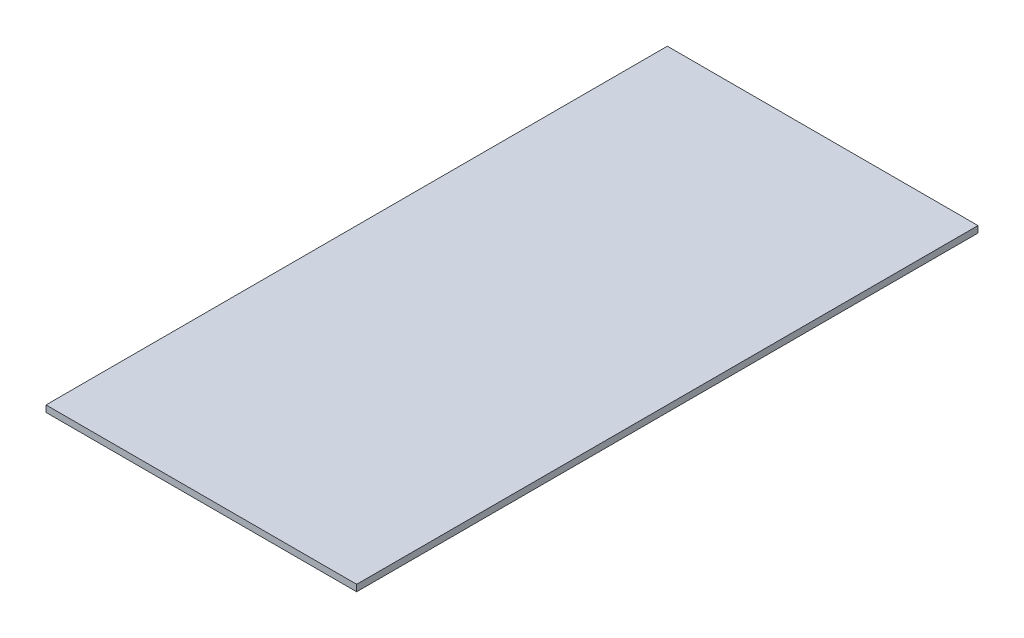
ISO-10303-21;
HEADER;
FILE_DESCRIPTION(('STEP AP214'),'2;1');
FILE_NAME('part.step','',(''),(''),'','','');
FILE_SCHEMA(('AUTOMOTIVE_DESIGN { 1 0 10303 214 1 1 1 1 }'));
ENDSEC;
DATA;
#1=APPLICATION_CONTEXT('core data for automotive mechanical design processes');
#2=APPLICATION_PROTOCOL_DEFINITION('international standard','automotive_design',2000,#1);
#3=PRODUCT_CONTEXT('',#1,'mechanical');
#4=PRODUCT('Part','Part','',(#3));
#5=PRODUCT_RELATED_PRODUCT_CATEGORY('part','',(#4));
#6=PRODUCT_DEFINITION_FORMATION('','',#4);
#7=PRODUCT_DEFINITION_CONTEXT('part definition',#1,'design');
#8=PRODUCT_DEFINITION('design','',#6,#7);
#9=PRODUCT_DEFINITION_SHAPE('','',#8);
#10=(LENGTH_UNIT() NAMED_UNIT(*) SI_UNIT(.MILLI.,.METRE.));
#11=(NAMED_UNIT(*) PLANE_ANGLE_UNIT() SI_UNIT($,.RADIAN.));
#12=(NAMED_UNIT(*) SI_UNIT($,.STERADIAN.) SOLID_ANGLE_UNIT());
#13=UNCERTAINTY_MEASURE_WITH_UNIT(LENGTH_MEASURE(1.E-05),#10,'distance_accuracy_value','');
#14=(GEOMETRIC_REPRESENTATION_CONTEXT(3) GLOBAL_UNCERTAINTY_ASSIGNED_CONTEXT((#13)) GLOBAL_UNIT_ASSIGNED_CONTEXT((#10,
#11,#12)) REPRESENTATION_CONTEXT('',''));
#15=CARTESIAN_POINT('',(0.,0.,0.));
#16=DIRECTION('',(0.,0.,1.));
#17=DIRECTION('',(1.,0.,0.));
#18=AXIS2_PLACEMENT_3D('',#15,#16,#17);
#19=CARTESIAN_POINT('',(0.,0.8001,-76.2));
#20=DIRECTION('',(0.,0.,1.));
#21=DIRECTION('',(1.,0.,0.));
#22=AXIS2_PLACEMENT_3D('',#19,#20,#21);
#23=PLANE('',#22);
#24=DIRECTION('',(-1.,0.,0.));
#25=VECTOR('',#24,1.);
#26=CARTESIAN_POINT('',(0.,-0.8001,-76.2));
#27=LINE('',#26,#25);
#28=CARTESIAN_POINT('',(76.2,-0.8001,-76.2));
#29=VERTEX_POINT('',#28);
#30=CARTESIAN_POINT('',(0.,-0.8001,-76.2));
#31=VERTEX_POINT('',#30);
#32=EDGE_CURVE('E97',#29,#31,#27,.T.);
#33=ORIENTED_EDGE('',*,*,#32,.T.);
#34=DIRECTION('',(0.,-1.,0.));
#35=VECTOR('',#34,1.);
#36=CARTESIAN_POINT('',(0.,0.8001,-76.2));
#37=LINE('',#36,#35);
#38=CARTESIAN_POINT('',(0.,0.8001,-76.2));
#39=VERTEX_POINT('',#38);
#40=EDGE_CURVE('E11',#39,#31,#37,.T.);
#41=ORIENTED_EDGE('',*,*,#40,.F.);
#42=DIRECTION('',(-1.,0.,0.));
#43=VECTOR('',#42,1.);
#44=CARTESIAN_POINT('',(0.,0.8001,-76.2));
#45=LINE('',#44,#43);
#46=CARTESIAN_POINT('',(76.2,0.8001,-76.2));
#47=VERTEX_POINT('',#46);
#48=EDGE_CURVE('E85',#47,#39,#45,.T.);
#49=ORIENTED_EDGE('',*,*,#48,.F.);
#50=DIRECTION('',(0.,-1.,0.));
#51=VECTOR('',#50,1.);
#52=CARTESIAN_POINT('',(76.2,0.8001,-76.2));
#53=LINE('',#52,#51);
#54=EDGE_CURVE('E93',#47,#29,#53,.T.);
#55=ORIENTED_EDGE('',*,*,#54,.T.);
#56=EDGE_LOOP('',(#33,#41,#49,#55));
#57=FACE_BOUND('',#56,.T.);
#58=ADVANCED_FACE('F34',(#57),#23,.F.);
#59=CARTESIAN_POINT('',(0.,0.8001,-76.2));
#60=DIRECTION('',(1.,0.,0.));
#61=DIRECTION('',(0.,0.,-1.));
#62=AXIS2_PLACEMENT_3D('',#59,#60,#61);
#63=PLANE('',#62);
#64=DIRECTION('',(0.,0.,1.));
#65=VECTOR('',#64,1.);
#66=CARTESIAN_POINT('',(0.,-0.8001,-76.2));
#67=LINE('',#66,#65);
#68=CARTESIAN_POINT('',(0.,-0.8001,76.2));
#69=VERTEX_POINT('',#68);
#70=EDGE_CURVE('E89',#31,#69,#67,.T.);
#71=ORIENTED_EDGE('',*,*,#70,.T.);
#72=DIRECTION('',(0.,-1.,0.));
#73=VECTOR('',#72,1.);
#74=CARTESIAN_POINT('',(0.,0.8001,76.2));
#75=LINE('',#74,#73);
#76=CARTESIAN_POINT('',(0.,0.8001,76.2));
#77=VERTEX_POINT('',#76);
#78=EDGE_CURVE('E42',#77,#69,#75,.T.);
#79=ORIENTED_EDGE('',*,*,#78,.F.);
#80=DIRECTION('',(0.,0.,1.));
#81=VECTOR('',#80,1.);
#82=CARTESIAN_POINT('',(0.,0.8001,-76.2));
#83=LINE('',#82,#81);
#84=EDGE_CURVE('E80',#39,#77,#83,.T.);
#85=ORIENTED_EDGE('',*,*,#84,.F.);
#86=ORIENTED_EDGE('',*,*,#40,.T.);
#87=EDGE_LOOP('',(#71,#79,#85,#86));
#88=FACE_BOUND('',#87,.T.);
#89=ADVANCED_FACE('F88',(#88),#63,.F.);
#90=CARTESIAN_POINT('',(0.,0.8001,76.2));
#91=DIRECTION('',(0.,0.,-1.));
#92=DIRECTION('',(-1.,0.,0.));
#93=AXIS2_PLACEMENT_3D('',#90,#91,#92);
#94=PLANE('',#93);
#95=DIRECTION('',(1.,0.,0.));
#96=VECTOR('',#95,1.);
#97=CARTESIAN_POINT('',(0.,-0.8001,76.2));
#98=LINE('',#97,#96);
#99=CARTESIAN_POINT('',(76.2,-0.8001,76.2));
#100=VERTEX_POINT('',#99);
#101=EDGE_CURVE('E67',#69,#100,#98,.T.);
#102=ORIENTED_EDGE('',*,*,#101,.T.);
#103=DIRECTION('',(0.,-1.,0.));
#104=VECTOR('',#103,1.);
#105=CARTESIAN_POINT('',(76.2,0.8001,76.2));
#106=LINE('',#105,#104);
#107=CARTESIAN_POINT('',(76.2,0.8001,76.2));
#108=VERTEX_POINT('',#107);
#109=EDGE_CURVE('E90',#108,#100,#106,.T.);
#110=ORIENTED_EDGE('',*,*,#109,.F.);
#111=DIRECTION('',(1.,0.,0.));
#112=VECTOR('',#111,1.);
#113=CARTESIAN_POINT('',(0.,0.8001,76.2));
#114=LINE('',#113,#112);
#115=EDGE_CURVE('E83',#77,#108,#114,.T.);
#116=ORIENTED_EDGE('',*,*,#115,.F.);
#117=ORIENTED_EDGE('',*,*,#78,.T.);
#118=EDGE_LOOP('',(#102,#110,#116,#117));
#119=FACE_BOUND('',#118,.T.);
#120=ADVANCED_FACE('F91',(#119),#94,.F.);
#121=CARTESIAN_POINT('',(76.2,0.8001,-76.2));
#122=DIRECTION('',(-1.,0.,0.));
#123=DIRECTION('',(0.,0.,1.));
#124=AXIS2_PLACEMENT_3D('',#121,#122,#123);
#125=PLANE('',#124);
#126=DIRECTION('',(0.,0.,-1.));
#127=VECTOR('',#126,1.);
#128=CARTESIAN_POINT('',(76.2,-0.8001,-76.2));
#129=LINE('',#128,#127);
#130=EDGE_CURVE('E73',#100,#29,#129,.T.);
#131=ORIENTED_EDGE('',*,*,#130,.T.);
#132=ORIENTED_EDGE('',*,*,#54,.F.);
#133=DIRECTION('',(0.,0.,-1.));
#134=VECTOR('',#133,1.);
#135=CARTESIAN_POINT('',(76.2,0.8001,-76.2));
#136=LINE('',#135,#134);
#137=EDGE_CURVE('E50',#108,#47,#136,.T.);
#138=ORIENTED_EDGE('',*,*,#137,.F.);
#139=ORIENTED_EDGE('',*,*,#109,.T.);
#140=EDGE_LOOP('',(#131,#132,#138,#139));
#141=FACE_BOUND('',#140,.T.);
#142=ADVANCED_FACE('F104',(#141),#125,.F.);
#143=CARTESIAN_POINT('',(0.,0.8001,0.));
#144=DIRECTION('',(0.,-1.,0.));
#145=DIRECTION('',(0.,0.,-1.));
#146=AXIS2_PLACEMENT_3D('',#143,#144,#145);
#147=PLANE('',#146);
#148=ORIENTED_EDGE('',*,*,#48,.T.);
#149=ORIENTED_EDGE('',*,*,#84,.T.);
#150=ORIENTED_EDGE('',*,*,#115,.T.);
#151=ORIENTED_EDGE('',*,*,#137,.T.);
#152=EDGE_LOOP('',(#148,#149,#150,#151));
#153=FACE_BOUND('',#152,.T.);
#154=ADVANCED_FACE('F81',(#153),#147,.F.);
#155=CARTESIAN_POINT('',(0.,-0.8001,0.));
#156=DIRECTION('',(0.,-1.,0.));
#157=DIRECTION('',(0.,0.,-1.));
#158=AXIS2_PLACEMENT_3D('',#155,#156,#157);
#159=PLANE('',#158);
#160=ORIENTED_EDGE('',*,*,#32,.F.);
#161=ORIENTED_EDGE('',*,*,#130,.F.);
#162=ORIENTED_EDGE('',*,*,#101,.F.);
#163=ORIENTED_EDGE('',*,*,#70,.F.);
#164=EDGE_LOOP('',(#160,#161,#162,#163));
#165=FACE_BOUND('',#164,.T.);
#166=ADVANCED_FACE('F107',(#165),#159,.T.);
#167=CLOSED_SHELL('',(#58,#89,#120,#142,#154,#166));
#168=MANIFOLD_SOLID_BREP('B2',#167);
#169=ADVANCED_BREP_SHAPE_REPRESENTATION('',(#18,#168),#14);
#170=SHAPE_DEFINITION_REPRESENTATION(#9,#169);
ENDSEC;
END-ISO-10303-21;
